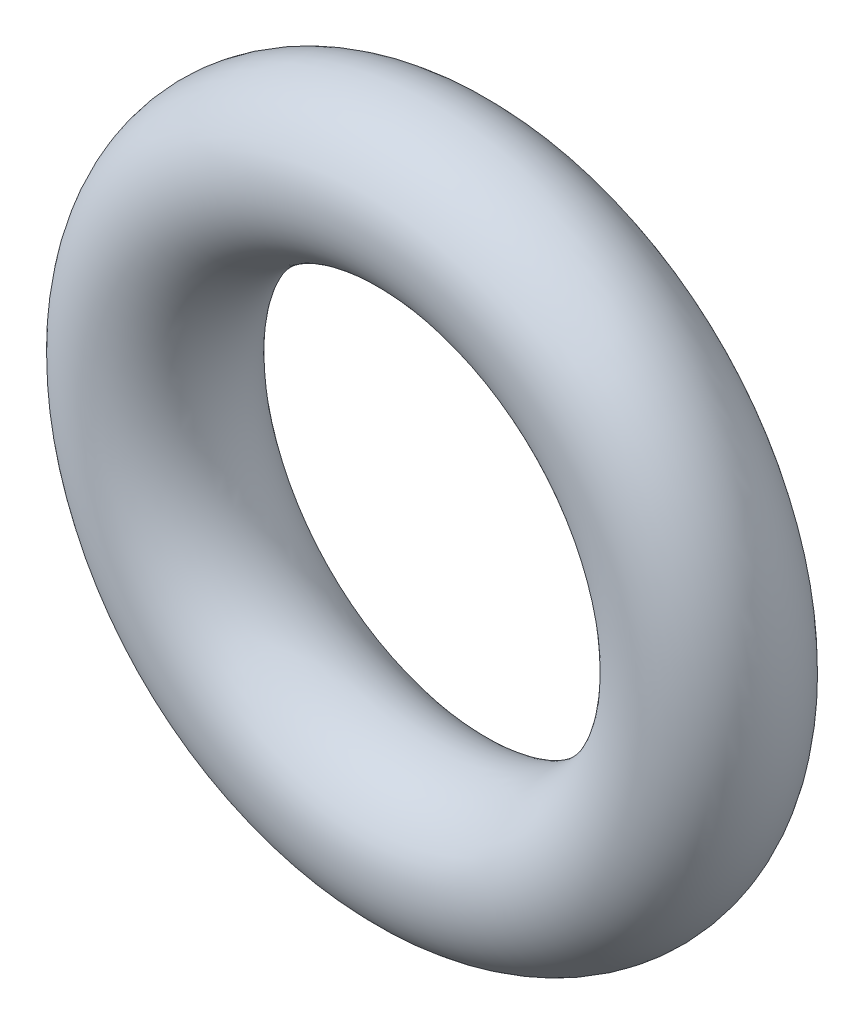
from build123d import *

# Parameters (mm, degrees)
SKETCH_1_R = 10


with BuildPart() as part:
    # Sketch 1 → Revolve 1 (revolve)
    with BuildSketch(Plane(origin=(0, 0, 0), x_dir=(1, 0, 0), z_dir=(0, 1, 0)), mode=Mode.PRIVATE) as revolve_1_sk:
        Circle(SKETCH_1_R)
    revolve(revolve_1_sk.sketch.rotate(Axis((-36, 0, -70.597058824), (0, 0, 1)), 180), axis=Axis((-36, 0, -70.597058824), (0, 0, 1)))


solid = part.part
